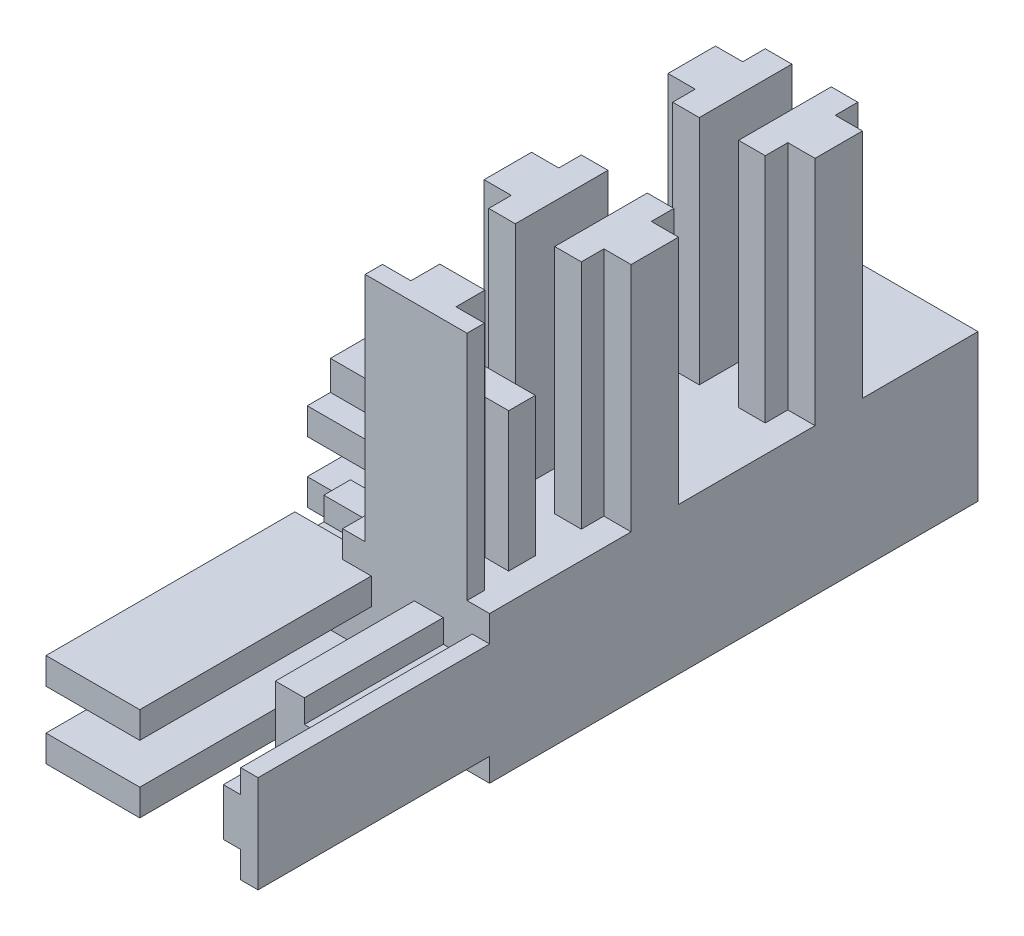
from build123d import *

# Parameters (mm, degrees)
SKETCH1_W                                            = 12.7
SKETCH1_H                                            = 12.7
BOSS_EXTRUDE1_DEPTH                                  = 44.44
BOSS_EXTRUDE3_DEPTH                                  = 20
BOSS_EXTRUDE4_DEPTH                                  = 31.74
BOSS_EXTRUDE5_DEPTH                                  = 20
SKETCH9_W                                            = 20
SKETCH9_H                                            = 8.980906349
CUT_EXTRUDE3_DEPTH                                   = 69.52794693
SKETCH11_W                                           = 8.1
SKETCH11_H                                           = 2.3
BOSS_EXTRUDE6_DEPTH                                  = 20
SKETCH18_W                                           = 3.3
SKETCH18_H                                           = 8.1
CUT_EXTRUDE7_DEPTH                                   = 8
SKETCH19_W                                           = 8
SKETCH19_H                                           = 2.3
CUT_EXTRUDE8_DEPTH                                   = 8
CUT_EXTRUDE9_DEPTH                                   = 8
CSK_FOR_M2_5_CROSS_RECESS_FLAT_HEAD_SCRE_D           = 3.1
CSK_FOR_M2_5_CROSS_RECESS_FLAT_HEAD_SCRE_DEPTH       = 5
CSK_FOR_M2_5_CROSS_RECESS_FLAT_HEAD_SCRE_CSINK_D     = 5.5
CSK_FOR_M2_5_CROSS_RECESS_FLAT_HEAD_SCRE_CSINK_ANGLE = 90
CSK_FOR_M2_5_CROSS_RECESS_FLAT_HEAD_SCRE_TIP         = 0.931333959
CSK_FOR_M2_5_CROSS_RECESS_FLAT_HEAD_2_D              = 3.1
CSK_FOR_M2_5_CROSS_RECESS_FLAT_HEAD_2_DEPTH          = 5
CSK_FOR_M2_5_CROSS_RECESS_FLAT_HEAD_2_CSINK_D        = 5.5
CSK_FOR_M2_5_CROSS_RECESS_FLAT_HEAD_2_CSINK_ANGLE    = 90
CSK_FOR_M2_5_CROSS_RECESS_FLAT_HEAD_2_TIP            = 0.931333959
CUT_EXTRUDE18_DEPTH                                  = 83.1132191
CUT_EXTRUDE18_DEPTH_BACK                             = 83.1132191
SKETCH42_W                                           = 44.44
SKETCH42_H                                           = 7.045
SKETCH43_W                                           = 12.7
SKETCH43_H                                           = 12.7
BOSS_EXTRUDE10_DEPTH                                 = 4.8
SKETCH45_W                                           = 8.25
SKETCH45_H                                           = 20
SKETCH45_W_2                                         = 18.47
SKETCH45_H_2                                         = 24
CUT_EXTRUDE19_DEPTH                                  = 78.931320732
CUT_EXTRUDE21_REACH                                  = 65.62
SKETCH46_W                                           = 29.354561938
SKETCH46_H                                           = 16.697411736
CUT_EXTRUDE21_DIRECTION_2_REACH                      = 65.62
SKETCH49_W                                           = 6.7
SKETCH49_H                                           = 6.7
CUT_EXTRUDE25_DEPTH                                  = 36
FILLET5_R                                            = 5


with BuildPart() as part:
    # Sketch1 → Boss-Extrude1 (new body)
    with BuildSketch(Plane.XY):
        with Locations((-0.907142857, 0.967619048)):
            Rectangle(SKETCH1_W, SKETCH1_H)
    extrude(amount=BOSS_EXTRUDE1_DEPTH)

    # Sketch4 → Boss-Extrude3 (add)
    with BuildSketch(Plane(origin=(0, 7.317619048, 0), x_dir=(1, 0, 0), z_dir=(0, 1, 0))):
        Polygon((1.042857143, -42.94), (3.492857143, -42.94), (3.492857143, -44.44), (-5.307142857, -44.44), (-5.307142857, -42.94), (-2.857142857, -42.94), (-2.857142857, -40.44), (-4.907142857, -40.44), (-4.907142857, -38.14), (3.092857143, -38.14), (3.092857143, -40.44), (1.042857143, -40.44), align=None)
        Polygon((1.042857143, -1.5), (3.092857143, -1.5), (3.092857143, 0), (-4.907142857, 0), (-4.907142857, -1.5), (-2.857142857, -1.5), (-2.857142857, -4), (-4.907142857, -4), (-4.907142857, -6.3), (3.092857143, -6.3), (3.092857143, -4), (1.042857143, -4), align=None)
        Polygon((-2.607142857, -26.165), (-2.607142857, -34.165), (-4.907142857, -34.165), (-4.907142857, -32.215), (-7.257142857, -32.215), (-7.257142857, -28.115), (-4.907142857, -28.115), (-4.907142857, -26.165), align=None)
        Polygon((0.792857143, -26.165), (0.792857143, -34.165), (3.092857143, -34.165), (3.092857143, -32.215), (5.442857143, -32.215), (5.442857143, -28.115), (3.092857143, -28.115), (3.092857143, -26.165), align=None)
        Polygon((-7.257142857, -16.325), (-7.257142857, -12.225), (-4.907142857, -12.225), (-4.907142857, -10.275), (-2.607142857, -10.275), (-2.607142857, -18.275), (-4.907142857, -18.275), (-4.907142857, -16.325), align=None)
        Polygon((3.092857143, -16.325), (3.092857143, -18.275), (0.792857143, -18.275), (0.792857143, -10.275), (3.092857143, -10.275), (3.092857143, -12.225), (5.442857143, -12.225), (5.442857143, -16.325), align=None)
    extrude(amount=BOSS_EXTRUDE3_DEPTH)

    # Sketch5 → Boss-Extrude4 (add)
    with BuildSketch(Plane.ZY.offset(7.257142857)):
        Polygon((1.5, 3.017619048), (1.5, 5.017619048), (0, 5.017619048), (0, -3.082380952), (1.5, -3.082380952), (1.5, -1.082380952), (4, -1.082380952), (4, -3.082380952), (6.3, -3.082380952), (6.3, 5.017619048), (4, 5.017619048), (4, 3.017619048), align=None)
        Polygon((42.94, 3.017619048), (42.94, 5.017619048), (44.44, 5.017619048), (44.44, -3.082380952), (42.94, -3.082380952), (42.94, -1.082380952), (40.44, -1.082380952), (40.44, -3.082380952), (38.14, -3.082380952), (38.14, 5.017619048), (40.44, 5.017619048), (40.44, 3.017619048), align=None)
        Polygon((16.32, -5.382380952), (12.22, -5.382380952), (12.22, -2.832380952), (10.22, -2.832380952), (10.22, -0.532380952), (18.32, -0.532380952), (18.32, -2.832380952), (16.32, -2.832380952), align=None)
        Polygon((16.32, 4.767619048), (18.32, 4.767619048), (18.32, 2.467619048), (10.22, 2.467619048), (10.22, 4.767619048), (12.22, 4.767619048), (12.22, 7.317619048), (16.32, 7.317619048), align=None)
        Polygon((26.12, -0.532380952), (34.22, -0.532380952), (34.22, -2.832380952), (32.22, -2.832380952), (32.22, -5.382380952), (28.12, -5.382380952), (28.12, -2.832380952), (26.12, -2.832380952), align=None)
        Polygon((26.12, 2.467619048), (34.22, 2.467619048), (34.22, 4.767619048), (32.22, 4.767619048), (32.22, 7.317619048), (28.12, 7.317619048), (28.12, 4.767619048), (26.12, 4.767619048), align=None)
    extrude(amount=BOSS_EXTRUDE4_DEPTH)

    # Sketch6 → Boss-Extrude5 (add)
    with BuildSketch(Plane(origin=(0, 0, 0), x_dir=(-1, 0, 0), z_dir=(0, 0, -1))):
        Polygon((1.857156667, 5.458072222), (-1.442843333, 5.458072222), (-1.442879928, 3.358072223), (-3.442857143, 3.367619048), (-3.442857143, -1.432380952), (-1.442879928, -1.422834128), (-1.442843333, -3.522834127), (1.857156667, -3.522834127), align=None)
    extrude(amount=BOSS_EXTRUDE5_DEPTH)

    # Sketch9 → Cut-Extrude3 (cut, through all)
    with BuildSketch(Plane(origin=(5.442857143, 0, 0), x_dir=(0, 0, -1), z_dir=(1, 0, 0))):
        with Locations((10, 0.967619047)):
            Rectangle(SKETCH9_W, SKETCH9_H)
    extrude(amount=-CUT_EXTRUDE3_DEPTH, mode=Mode.SUBTRACT)

    # Sketch11 → Boss-Extrude6 (add)
    with BuildSketch(Plane.XY.offset(44.44)):
        Polygon((3.942857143, 3.017619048), (3.942857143, 5.039728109), (5.442857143, 5.039728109), (5.442857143, -3.360271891), (3.942857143, -3.360271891), (3.942857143, -1.082380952), (1.442857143, -1.082380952), (1.442857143, -3.082380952), (-1.057142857, -3.082380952), (-1.057142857, 5.017619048), (1.442857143, 5.017619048), (1.442857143, 3.017619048), align=None)
        with Locations((-8.827142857, -1.932380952)):
            Rectangle(SKETCH11_W, SKETCH11_H)
        with Locations((-8.827142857, 3.867619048)):
            Rectangle(SKETCH11_W, SKETCH11_H)
        with Locations((-24.727142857, -1.932380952)):
            Rectangle(SKETCH11_W, SKETCH11_H)
        with Locations((-24.727142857, 3.867619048)):
            Rectangle(SKETCH11_W, SKETCH11_H)
        Polygon((-34.997142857, -1.082380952), (-37.497142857, -1.082380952), (-37.497142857, -3.082380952), (-38.997142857, -3.082380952), (-38.997142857, 5.017619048), (-37.497142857, 5.017619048), (-37.497142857, 3.017619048), (-34.997142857, 3.017619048), (-34.997142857, 5.017619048), (-32.497142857, 5.017619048), (-32.497142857, -3.082380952), (-34.997142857, -3.082380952), align=None)
    extrude(amount=BOSS_EXTRUDE6_DEPTH)

    # Sketch18 → Cut-Extrude7 (cut)
    with BuildSketch(Plane.ZY.offset(38.997142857)):
        with Locations((4.65, 0.967619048)):
            Rectangle(SKETCH18_W, SKETCH18_H)
    extrude(amount=-CUT_EXTRUDE7_DEPTH, mode=Mode.SUBTRACT)

    # Sketch19 → Cut-Extrude8 (cut)
    with BuildSketch(Plane(origin=(0, 27.317619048, 0), x_dir=(1, 0, 0), z_dir=(0, 1, 0))):
        with Locations((-0.907142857, -5.15)):
            Rectangle(SKETCH19_W, SKETCH19_H)
        with Locations((-0.907142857, -39.29)):
            Rectangle(SKETCH19_W, SKETCH19_H)
    extrude(amount=-CUT_EXTRUDE8_DEPTH, mode=Mode.SUBTRACT)

    # Sketch21 → Cut-Extrude9 (cut)
    with BuildSketch(Plane.XY.offset(64.44)):
        Polygon((-35.997142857, 3.239728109), (-36.02657045, -3.378044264), (-32.497142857, -3.378044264), (-32.497142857, 5.017619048), (-35.997142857, 5.017619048), align=None)
        Polygon((2.442857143, 5.039728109), (-1.057142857, 5.039728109), (-1.057142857, -3.082380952), (2.142857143, -3.082380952), (2.442857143, -1.560271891), align=None)
    extrude(amount=-CUT_EXTRUDE9_DEPTH, mode=Mode.SUBTRACT)

    # CSK for M2.5 Cross Recess Flat Head Scre
    with Locations(Plane(origin=(0, 0, 0), x_dir=(-1, 0, 0), z_dir=(0, 0, -1))):
        with Locations((33.997142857, 0.839728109), (0.907142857, 22.317619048)):
            CounterSinkHole(CSK_FOR_M2_5_CROSS_RECESS_FLAT_HEAD_SCRE_D / 2, CSK_FOR_M2_5_CROSS_RECESS_FLAT_HEAD_SCRE_CSINK_D / 2, depth=CSK_FOR_M2_5_CROSS_RECESS_FLAT_HEAD_SCRE_DEPTH, counter_sink_angle=CSK_FOR_M2_5_CROSS_RECESS_FLAT_HEAD_SCRE_CSINK_ANGLE)
            with Locations((0, 0, -(CSK_FOR_M2_5_CROSS_RECESS_FLAT_HEAD_SCRE_DEPTH + CSK_FOR_M2_5_CROSS_RECESS_FLAT_HEAD_SCRE_TIP / 2))):  # 118° drill point
                Cone(0, CSK_FOR_M2_5_CROSS_RECESS_FLAT_HEAD_SCRE_D / 2, CSK_FOR_M2_5_CROSS_RECESS_FLAT_HEAD_SCRE_TIP, mode=Mode.SUBTRACT)

    # CSK for M2.5 Cross Recess Flat Head  2
    with Locations(Plane.ZY.offset(38.997142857)):
        with Locations((59.44, 0.839728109)):
            CounterSinkHole(CSK_FOR_M2_5_CROSS_RECESS_FLAT_HEAD_2_D / 2, CSK_FOR_M2_5_CROSS_RECESS_FLAT_HEAD_2_CSINK_D / 2, depth=CSK_FOR_M2_5_CROSS_RECESS_FLAT_HEAD_2_DEPTH, counter_sink_angle=CSK_FOR_M2_5_CROSS_RECESS_FLAT_HEAD_2_CSINK_ANGLE)
            with Locations((0, 0, -(CSK_FOR_M2_5_CROSS_RECESS_FLAT_HEAD_2_DEPTH + CSK_FOR_M2_5_CROSS_RECESS_FLAT_HEAD_2_TIP / 2))):  # 118° drill point
                Cone(0, CSK_FOR_M2_5_CROSS_RECESS_FLAT_HEAD_2_D / 2, CSK_FOR_M2_5_CROSS_RECESS_FLAT_HEAD_2_TIP, mode=Mode.SUBTRACT)

    # Sketch42 → Cut-Extrude18 (cut, two sides: drawn at the far end of the back side and taken through both)
    with BuildSketch(Plane(origin=(0, 27.317619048, 0), x_dir=(1, 0, 0), z_dir=(0, 1, 0)).offset(-CUT_EXTRUDE18_DEPTH_BACK)):
        with Locations((-16.777142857, -3.5225)):
            Rectangle(SKETCH42_W, SKETCH42_H)
    extrude(amount=CUT_EXTRUDE18_DEPTH + CUT_EXTRUDE18_DEPTH_BACK, mode=Mode.SUBTRACT)

    # Sketch43 → Boss-Extrude10 (add)
    with BuildSketch(Plane(origin=(0, 0, 7.045), x_dir=(-1, 0, 0), z_dir=(0, 0, -1))):
        with Locations((0.907142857, 0.967619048)):
            Rectangle(SKETCH43_W, SKETCH43_H)
    extrude(amount=BOSS_EXTRUDE10_DEPTH)

    # Sketch45 → Cut-Extrude19 (cut, through all)
    with BuildSketch(Plane(origin=(0, 7.317619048, 0), x_dir=(1, 0, 0), z_dir=(0, 1, 0))):
        with Locations((-24.802142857, -54.44)):
            Rectangle(SKETCH45_W, SKETCH45_H)
        with Locations((-29.762142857, -22.22)):
            Rectangle(SKETCH45_W_2, SKETCH45_H_2)
    extrude(amount=-CUT_EXTRUDE19_DEPTH, mode=Mode.SUBTRACT)

    # Cut-Extrude21: up to this face of the body (flat: up to its plane)
    cut_extrude21_end = Plane(part.part.faces().sort_by_distance((-23.127142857, 0.967619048, 38.14))[0])
    # Sketch46 → Cut-Extrude21 (cut, up to the picked face)
    with BuildSketch(Plane.XY.offset(44.44), mode=Mode.PRIVATE) as cut_extrude21_sk1:
        with Locations((-27.554423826, 1.448099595)):
            Rectangle(SKETCH46_W, SKETCH46_H)
    cut_extrude21_tool1 = split(extrude(cut_extrude21_sk1.sketch, amount=-CUT_EXTRUDE21_REACH, mode=Mode.PRIVATE), bisect_by=cut_extrude21_end, keep=Keep.BOTH, mode=Mode.PRIVATE)
    add(cut_extrude21_tool1.solids().sort_by(Axis((-27.554424, 1.4481, 44.44), (0, 0, -1)))[0], mode=Mode.SUBTRACT)

    # Cut-Extrude21 direction 2: up to this face of the body (flat: up to its plane)
    cut_extrude21_direction_2_end = Plane(part.part.faces().sort_by_distance((-37.746990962, 0.969017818, 64.44))[0])
    # Sketch46 → Cut-Extrude21 direction 2 (cut, up to the picked face)
    with BuildSketch(Plane.XY.offset(44.44), mode=Mode.PRIVATE) as cut_extrude21_direction_2_sk1:
        with Locations((-27.554423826, 1.448099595)):
            Rectangle(SKETCH46_W, SKETCH46_H)
    cut_extrude21_direction_2_tool1 = split(extrude(cut_extrude21_direction_2_sk1.sketch, amount=CUT_EXTRUDE21_DIRECTION_2_REACH, mode=Mode.PRIVATE), bisect_by=cut_extrude21_direction_2_end, keep=Keep.BOTH, mode=Mode.PRIVATE)
    add(cut_extrude21_direction_2_tool1.solids().sort_by(Axis((-27.554424, 1.4481, 44.44), (0, 0, 1)))[0], mode=Mode.SUBTRACT)

    # Sketch49 → Cut-Extrude25 (cut)
    with BuildSketch(Plane(origin=(0, 0, 5.245), x_dir=(-1, 0, 0), z_dir=(0, 0, -1))):
        with Locations((0.907142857, 0.967619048)):
            Rectangle(SKETCH49_W, SKETCH49_H)
    extrude(amount=-CUT_EXTRUDE25_DEPTH, mode=Mode.SUBTRACT)

    # Fillet5
    fillet5_edges = [part.edges().sort_by_distance(p)[0] for p in [
        (-7.257142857, 7.317619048, 14.2725),
        (-7.257142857, 7.317619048, 30.1675),
    ]]
    fillet(fillet5_edges, radius=FILLET5_R)


solid = part.part
